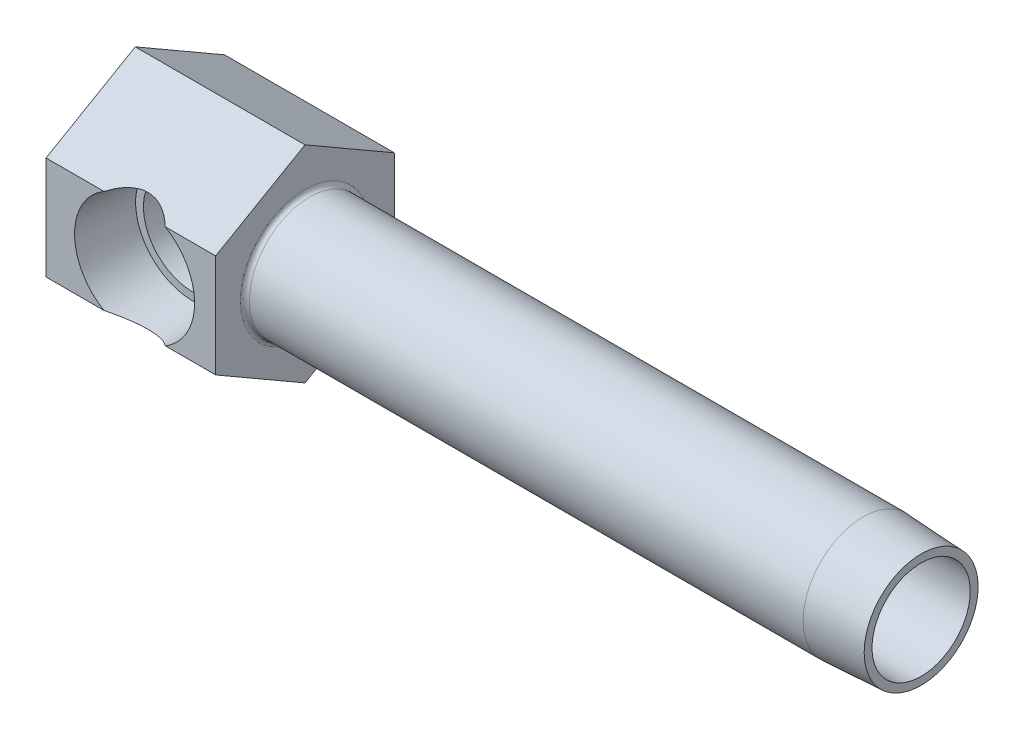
ISO-10303-21;
HEADER;
FILE_DESCRIPTION(('STEP AP214'),'2;1');
FILE_NAME('part.step','',(''),(''),'','','');
FILE_SCHEMA(('AUTOMOTIVE_DESIGN { 1 0 10303 214 1 1 1 1 }'));
ENDSEC;
DATA;
#1=APPLICATION_CONTEXT('core data for automotive mechanical design processes');
#2=APPLICATION_PROTOCOL_DEFINITION('international standard','automotive_design',2000,#1);
#3=PRODUCT_CONTEXT('',#1,'mechanical');
#4=PRODUCT('Part','Part','',(#3));
#5=PRODUCT_RELATED_PRODUCT_CATEGORY('part','',(#4));
#6=PRODUCT_DEFINITION_FORMATION('','',#4);
#7=PRODUCT_DEFINITION_CONTEXT('part definition',#1,'design');
#8=PRODUCT_DEFINITION('design','',#6,#7);
#9=PRODUCT_DEFINITION_SHAPE('','',#8);
#10=(LENGTH_UNIT() NAMED_UNIT(*) SI_UNIT(.MILLI.,.METRE.));
#11=(NAMED_UNIT(*) PLANE_ANGLE_UNIT() SI_UNIT($,.RADIAN.));
#12=(NAMED_UNIT(*) SI_UNIT($,.STERADIAN.) SOLID_ANGLE_UNIT());
#13=UNCERTAINTY_MEASURE_WITH_UNIT(LENGTH_MEASURE(1.E-05),#10,'distance_accuracy_value','');
#14=(GEOMETRIC_REPRESENTATION_CONTEXT(3) GLOBAL_UNCERTAINTY_ASSIGNED_CONTEXT((#13)) GLOBAL_UNIT_ASSIGNED_CONTEXT((#10,
#11,#12)) REPRESENTATION_CONTEXT('',''));
#15=CARTESIAN_POINT('',(0.,0.,0.));
#16=DIRECTION('',(0.,0.,1.));
#17=DIRECTION('',(1.,0.,0.));
#18=AXIS2_PLACEMENT_3D('',#15,#16,#17);
#19=CARTESIAN_POINT('',(139.7,0.,15.875));
#20=DIRECTION('',(-1.,0.,0.));
#21=DIRECTION('',(0.,0.,1.));
#22=AXIS2_PLACEMENT_3D('',#19,#20,#21);
#23=PLANE('',#22);
#24=CARTESIAN_POINT('',(139.7,0.,15.875));
#25=DIRECTION('',(1.,0.,0.));
#26=DIRECTION('',(0.,0.,-1.));
#27=AXIS2_PLACEMENT_3D('',#24,#25,#26);
#28=CIRCLE('',#27,8.73124999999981);
#29=CARTESIAN_POINT('',(139.7,0.,7.14375000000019));
#30=VERTEX_POINT('',#29);
#31=EDGE_CURVE('E298',#30,#30,#28,.T.);
#32=ORIENTED_EDGE('',*,*,#31,.F.);
#33=EDGE_LOOP('',(#32));
#34=FACE_BOUND('',#33,.T.);
#35=CARTESIAN_POINT('',(139.7,0.,15.875));
#36=DIRECTION('',(-1.,0.,0.));
#37=DIRECTION('',(0.,0.,1.));
#38=AXIS2_PLACEMENT_3D('',#35,#36,#37);
#39=CIRCLE('',#38,10.127550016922);
#40=CARTESIAN_POINT('',(139.7,0.,26.002550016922));
#41=VERTEX_POINT('',#40);
#42=EDGE_CURVE('E317',#41,#41,#39,.T.);
#43=ORIENTED_EDGE('',*,*,#42,.F.);
#44=EDGE_LOOP('',(#43));
#45=FACE_BOUND('',#44,.T.);
#46=ADVANCED_FACE('F15',(#34,#45),#23,.F.);
#47=CARTESIAN_POINT('',(30.1625,18.3308710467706,15.875));
#48=DIRECTION('',(0.,-0.866025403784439,-0.5));
#49=DIRECTION('',(0.,0.5,-0.866025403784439));
#50=AXIS2_PLACEMENT_3D('',#47,#48,#49);
#51=PLANE('',#50);
#52=DIRECTION('',(0.,-0.5,0.866025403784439));
#53=VECTOR('',#52,1.);
#54=CARTESIAN_POINT('',(0.,18.3308710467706,15.875));
#55=LINE('',#54,#53);
#56=CARTESIAN_POINT('',(0.,18.3308710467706,15.875));
#57=VERTEX_POINT('',#56);
#58=CARTESIAN_POINT('',(0.,9.16543552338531,31.75));
#59=VERTEX_POINT('',#58);
#60=EDGE_CURVE('E146',#57,#59,#55,.T.);
#61=ORIENTED_EDGE('',*,*,#60,.T.);
#62=DIRECTION('',(-1.,0.,0.));
#63=VECTOR('',#62,1.);
#64=CARTESIAN_POINT('',(30.1625,9.16543552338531,31.75));
#65=LINE('',#64,#63);
#66=CARTESIAN_POINT('',(10.2889693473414,9.16543552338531,31.75));
#67=VERTEX_POINT('',#66);
#68=EDGE_CURVE('E177',#67,#59,#65,.T.);
#69=ORIENTED_EDGE('',*,*,#68,.F.);
#70=CARTESIAN_POINT('',(15.748,-1.05255916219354,49.4480859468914));
#71=DIRECTION('',(0.,-0.866025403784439,-0.5));
#72=DIRECTION('',(0.,-0.5,0.866025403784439));
#73=AXIS2_PLACEMENT_3D('',#70,#71,#72);
#74=ELLIPSE('',#73,23.191034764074,11.5476466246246);
#75=CARTESIAN_POINT('',(21.2070306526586,9.16543552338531,31.75));
#76=VERTEX_POINT('',#75);
#77=EDGE_CURVE('E137',#76,#67,#74,.F.);
#78=ORIENTED_EDGE('',*,*,#77,.F.);
#79=CARTESIAN_POINT('',(30.1625,9.16543552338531,31.75));
#80=VERTEX_POINT('',#79);
#81=EDGE_CURVE('E178',#80,#76,#65,.T.);
#82=ORIENTED_EDGE('',*,*,#81,.F.);
#83=DIRECTION('',(0.,-0.5,0.866025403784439));
#84=VECTOR('',#83,1.);
#85=CARTESIAN_POINT('',(30.1625,18.3308710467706,15.875));
#86=LINE('',#85,#84);
#87=CARTESIAN_POINT('',(30.1625,18.3308710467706,15.875));
#88=VERTEX_POINT('',#87);
#89=EDGE_CURVE('E162',#88,#80,#86,.T.);
#90=ORIENTED_EDGE('',*,*,#89,.F.);
#91=DIRECTION('',(-1.,0.,0.));
#92=VECTOR('',#91,1.);
#93=CARTESIAN_POINT('',(30.1625,18.3308710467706,15.875));
#94=LINE('',#93,#92);
#95=EDGE_CURVE('E181',#88,#57,#94,.T.);
#96=ORIENTED_EDGE('',*,*,#95,.T.);
#97=EDGE_LOOP('',(#61,#69,#78,#82,#90,#96));
#98=FACE_BOUND('',#97,.T.);
#99=ADVANCED_FACE('F210',(#98),#51,.F.);
#100=CARTESIAN_POINT('',(30.1625,9.16543552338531,31.75));
#101=DIRECTION('',(0.,0.,-1.));
#102=DIRECTION('',(-1.,0.,0.));
#103=AXIS2_PLACEMENT_3D('',#100,#101,#102);
#104=PLANE('',#103);
#105=CARTESIAN_POINT('',(15.748,0.,31.75));
#106=DIRECTION('',(0.,0.,-1.));
#107=DIRECTION('',(-1.,0.,0.));
#108=AXIS2_PLACEMENT_3D('',#105,#106,#107);
#109=CIRCLE('',#108,10.668);
#110=CARTESIAN_POINT('',(21.2070306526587,-9.1654355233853,31.75));
#111=VERTEX_POINT('',#110);
#112=EDGE_CURVE('E135',#76,#111,#109,.T.);
#113=ORIENTED_EDGE('',*,*,#112,.T.);
#114=DIRECTION('',(-1.,0.,0.));
#115=VECTOR('',#114,1.);
#116=CARTESIAN_POINT('',(30.1625,-9.1654355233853,31.75));
#117=LINE('',#116,#115);
#118=CARTESIAN_POINT('',(30.1625,-9.1654355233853,31.75));
#119=VERTEX_POINT('',#118);
#120=EDGE_CURVE('E174',#119,#111,#117,.T.);
#121=ORIENTED_EDGE('',*,*,#120,.F.);
#122=DIRECTION('',(0.,-1.,0.));
#123=VECTOR('',#122,1.);
#124=CARTESIAN_POINT('',(30.1625,9.16543552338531,31.75));
#125=LINE('',#124,#123);
#126=EDGE_CURVE('E164',#80,#119,#125,.T.);
#127=ORIENTED_EDGE('',*,*,#126,.F.);
#128=ORIENTED_EDGE('',*,*,#81,.T.);
#129=EDGE_LOOP('',(#113,#121,#127,#128));
#130=FACE_BOUND('',#129,.T.);
#131=ADVANCED_FACE('F206',(#130),#104,.F.);
#132=DIRECTION('',(0.,-1.,0.));
#133=VECTOR('',#132,1.);
#134=CARTESIAN_POINT('',(0.,9.16543552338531,31.75));
#135=LINE('',#134,#133);
#136=CARTESIAN_POINT('',(0.,-9.1654355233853,31.75));
#137=VERTEX_POINT('',#136);
#138=EDGE_CURVE('E149',#59,#137,#135,.T.);
#139=ORIENTED_EDGE('',*,*,#138,.T.);
#140=CARTESIAN_POINT('',(10.2889693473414,-9.1654355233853,31.75));
#141=VERTEX_POINT('',#140);
#142=EDGE_CURVE('E173',#141,#137,#117,.T.);
#143=ORIENTED_EDGE('',*,*,#142,.F.);
#144=EDGE_CURVE('E43',#141,#67,#109,.T.);
#145=ORIENTED_EDGE('',*,*,#144,.T.);
#146=ORIENTED_EDGE('',*,*,#68,.T.);
#147=EDGE_LOOP('',(#139,#143,#145,#146));
#148=FACE_BOUND('',#147,.T.);
#149=ADVANCED_FACE('F216',(#148),#104,.F.);
#150=CARTESIAN_POINT('',(30.1625,-9.1654355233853,31.75));
#151=DIRECTION('',(0.,0.866025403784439,-0.5));
#152=DIRECTION('',(0.,0.5,0.866025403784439));
#153=AXIS2_PLACEMENT_3D('',#150,#151,#152);
#154=PLANE('',#153);
#155=DIRECTION('',(0.,-0.5,-0.866025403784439));
#156=VECTOR('',#155,1.);
#157=CARTESIAN_POINT('',(0.,-9.1654355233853,31.75));
#158=LINE('',#157,#156);
#159=CARTESIAN_POINT('',(0.,-18.3308710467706,15.875));
#160=VERTEX_POINT('',#159);
#161=EDGE_CURVE('E152',#137,#160,#158,.T.);
#162=ORIENTED_EDGE('',*,*,#161,.T.);
#163=DIRECTION('',(-1.,0.,0.));
#164=VECTOR('',#163,1.);
#165=CARTESIAN_POINT('',(30.1625,-18.3308710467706,15.875));
#166=LINE('',#165,#164);
#167=CARTESIAN_POINT('',(30.1625,-18.3308710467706,15.875));
#168=VERTEX_POINT('',#167);
#169=EDGE_CURVE('E168',#168,#160,#166,.T.);
#170=ORIENTED_EDGE('',*,*,#169,.F.);
#171=DIRECTION('',(0.,-0.5,-0.866025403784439));
#172=VECTOR('',#171,1.);
#173=CARTESIAN_POINT('',(30.1625,-9.1654355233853,31.75));
#174=LINE('',#173,#172);
#175=EDGE_CURVE('E166',#119,#168,#174,.T.);
#176=ORIENTED_EDGE('',*,*,#175,.F.);
#177=ORIENTED_EDGE('',*,*,#120,.T.);
#178=CARTESIAN_POINT('',(15.748,1.05255916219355,49.4480859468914));
#179=DIRECTION('',(0.,0.866025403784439,-0.5));
#180=DIRECTION('',(0.,0.5,0.866025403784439));
#181=AXIS2_PLACEMENT_3D('',#178,#179,#180);
#182=ELLIPSE('',#181,23.191034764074,11.5476466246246);
#183=EDGE_CURVE('E29',#141,#111,#182,.F.);
#184=ORIENTED_EDGE('',*,*,#183,.F.);
#185=ORIENTED_EDGE('',*,*,#142,.T.);
#186=EDGE_LOOP('',(#162,#170,#176,#177,#184,#185));
#187=FACE_BOUND('',#186,.T.);
#188=ADVANCED_FACE('F202',(#187),#154,.F.);
#189=CARTESIAN_POINT('',(30.1625,-18.3308710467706,15.875));
#190=DIRECTION('',(0.,0.866025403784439,0.5));
#191=DIRECTION('',(0.,-0.5,0.866025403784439));
#192=AXIS2_PLACEMENT_3D('',#189,#190,#191);
#193=PLANE('',#192);
#194=DIRECTION('',(0.,0.5,-0.866025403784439));
#195=VECTOR('',#194,1.);
#196=CARTESIAN_POINT('',(0.,-18.3308710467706,15.875));
#197=LINE('',#196,#195);
#198=CARTESIAN_POINT('',(0.,-9.16543552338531,0.));
#199=VERTEX_POINT('',#198);
#200=EDGE_CURVE('E139',#160,#199,#197,.T.);
#201=ORIENTED_EDGE('',*,*,#200,.T.);
#202=DIRECTION('',(-1.,0.,0.));
#203=VECTOR('',#202,1.);
#204=CARTESIAN_POINT('',(30.1625,-9.16543552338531,0.));
#205=LINE('',#204,#203);
#206=CARTESIAN_POINT('',(30.1625,-9.16543552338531,0.));
#207=VERTEX_POINT('',#206);
#208=EDGE_CURVE('E187',#207,#199,#205,.T.);
#209=ORIENTED_EDGE('',*,*,#208,.F.);
#210=DIRECTION('',(0.,0.5,-0.866025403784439));
#211=VECTOR('',#210,1.);
#212=CARTESIAN_POINT('',(30.1625,-18.3308710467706,15.875));
#213=LINE('',#212,#211);
#214=EDGE_CURVE('E155',#168,#207,#213,.T.);
#215=ORIENTED_EDGE('',*,*,#214,.F.);
#216=ORIENTED_EDGE('',*,*,#169,.T.);
#217=EDGE_LOOP('',(#201,#209,#215,#216));
#218=FACE_BOUND('',#217,.T.);
#219=ADVANCED_FACE('F225',(#218),#193,.F.);
#220=CARTESIAN_POINT('',(30.1625,-9.16543552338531,0.));
#221=DIRECTION('',(0.,0.,1.));
#222=DIRECTION('',(0.,-1.,0.));
#223=AXIS2_PLACEMENT_3D('',#220,#221,#222);
#224=PLANE('',#223);
#225=DIRECTION('',(0.,1.,0.));
#226=VECTOR('',#225,1.);
#227=CARTESIAN_POINT('',(0.,-9.16543552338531,0.));
#228=LINE('',#227,#226);
#229=CARTESIAN_POINT('',(0.,9.16543552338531,0.));
#230=VERTEX_POINT('',#229);
#231=EDGE_CURVE('E140',#199,#230,#228,.T.);
#232=ORIENTED_EDGE('',*,*,#231,.T.);
#233=DIRECTION('',(-1.,0.,0.));
#234=VECTOR('',#233,1.);
#235=CARTESIAN_POINT('',(30.1625,9.16543552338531,0.));
#236=LINE('',#235,#234);
#237=CARTESIAN_POINT('',(30.1625,9.16543552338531,0.));
#238=VERTEX_POINT('',#237);
#239=EDGE_CURVE('E184',#238,#230,#236,.T.);
#240=ORIENTED_EDGE('',*,*,#239,.F.);
#241=DIRECTION('',(0.,1.,0.));
#242=VECTOR('',#241,1.);
#243=CARTESIAN_POINT('',(30.1625,-9.16543552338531,0.));
#244=LINE('',#243,#242);
#245=EDGE_CURVE('E158',#207,#238,#244,.T.);
#246=ORIENTED_EDGE('',*,*,#245,.F.);
#247=ORIENTED_EDGE('',*,*,#208,.T.);
#248=EDGE_LOOP('',(#232,#240,#246,#247));
#249=FACE_BOUND('',#248,.T.);
#250=ADVANCED_FACE('F235',(#249),#224,.F.);
#251=CARTESIAN_POINT('',(30.1625,9.16543552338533,0.));
#252=DIRECTION('',(0.,-0.86602540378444,0.5));
#253=DIRECTION('',(0.,-0.5,-0.86602540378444));
#254=AXIS2_PLACEMENT_3D('',#251,#252,#253);
#255=PLANE('',#254);
#256=DIRECTION('',(0.,0.5,0.86602540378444));
#257=VECTOR('',#256,1.);
#258=CARTESIAN_POINT('',(0.,9.16543552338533,0.));
#259=LINE('',#258,#257);
#260=EDGE_CURVE('E143',#230,#57,#259,.T.);
#261=ORIENTED_EDGE('',*,*,#260,.T.);
#262=ORIENTED_EDGE('',*,*,#95,.F.);
#263=DIRECTION('',(0.,0.5,0.86602540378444));
#264=VECTOR('',#263,1.);
#265=CARTESIAN_POINT('',(30.1625,9.16543552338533,0.));
#266=LINE('',#265,#264);
#267=EDGE_CURVE('E160',#238,#88,#266,.T.);
#268=ORIENTED_EDGE('',*,*,#267,.F.);
#269=ORIENTED_EDGE('',*,*,#239,.T.);
#270=EDGE_LOOP('',(#261,#262,#268,#269));
#271=FACE_BOUND('',#270,.T.);
#272=ADVANCED_FACE('F233',(#271),#255,.F.);
#273=CARTESIAN_POINT('',(30.1625,-9.16543552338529,0.));
#274=DIRECTION('',(1.,0.,0.));
#275=DIRECTION('',(0.,1.,0.));
#276=AXIS2_PLACEMENT_3D('',#273,#274,#275);
#277=PLANE('',#276);
#278=CARTESIAN_POINT('',(30.1625,0.,15.875));
#279=DIRECTION('',(1.,0.,0.));
#280=DIRECTION('',(0.,1.,0.));
#281=AXIS2_PLACEMENT_3D('',#278,#279,#280);
#282=CIRCLE('',#281,11.4554);
#283=CARTESIAN_POINT('',(30.1625,11.4554,15.875));
#284=VERTEX_POINT('',#283);
#285=EDGE_CURVE('E193',#284,#284,#282,.F.);
#286=ORIENTED_EDGE('',*,*,#285,.T.);
#287=EDGE_LOOP('',(#286));
#288=FACE_BOUND('',#287,.T.);
#289=ORIENTED_EDGE('',*,*,#214,.T.);
#290=ORIENTED_EDGE('',*,*,#245,.T.);
#291=ORIENTED_EDGE('',*,*,#267,.T.);
#292=ORIENTED_EDGE('',*,*,#89,.T.);
#293=ORIENTED_EDGE('',*,*,#126,.T.);
#294=ORIENTED_EDGE('',*,*,#175,.T.);
#295=EDGE_LOOP('',(#289,#290,#291,#292,#293,#294));
#296=FACE_BOUND('',#295,.T.);
#297=ADVANCED_FACE('F228',(#288,#296),#277,.T.);
#298=CARTESIAN_POINT('',(0.,-9.16543552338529,0.));
#299=DIRECTION('',(1.,0.,0.));
#300=DIRECTION('',(0.,1.,0.));
#301=AXIS2_PLACEMENT_3D('',#298,#299,#300);
#302=PLANE('',#301);
#303=ORIENTED_EDGE('',*,*,#60,.F.);
#304=ORIENTED_EDGE('',*,*,#260,.F.);
#305=ORIENTED_EDGE('',*,*,#231,.F.);
#306=ORIENTED_EDGE('',*,*,#200,.F.);
#307=ORIENTED_EDGE('',*,*,#161,.F.);
#308=ORIENTED_EDGE('',*,*,#138,.F.);
#309=EDGE_LOOP('',(#303,#304,#305,#306,#307,#308));
#310=FACE_BOUND('',#309,.T.);
#311=ADVANCED_FACE('F219',(#310),#302,.F.);
#312=CARTESIAN_POINT('',(139.7,0.,15.875));
#313=DIRECTION('',(-1.,0.,0.));
#314=DIRECTION('',(0.,0.,1.));
#315=AXIS2_PLACEMENT_3D('',#312,#313,#314);
#316=CYLINDRICAL_SURFACE('',#315,10.668);
#317=CARTESIAN_POINT('',(129.3876,0.,15.875));
#318=DIRECTION('',(-1.,0.,0.));
#319=DIRECTION('',(0.,0.,1.));
#320=AXIS2_PLACEMENT_3D('',#317,#318,#319);
#321=CIRCLE('',#320,10.6680000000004);
#322=CARTESIAN_POINT('',(129.3876,0.,26.5430000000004));
#323=VERTEX_POINT('',#322);
#324=EDGE_CURVE('E314',#323,#323,#321,.T.);
#325=ORIENTED_EDGE('',*,*,#324,.T.);
#326=EDGE_LOOP('',(#325));
#327=FACE_BOUND('',#326,.T.);
#328=CARTESIAN_POINT('',(30.9499,0.,15.875));
#329=DIRECTION('',(1.,0.,0.));
#330=DIRECTION('',(0.,1.,0.));
#331=AXIS2_PLACEMENT_3D('',#328,#329,#330);
#332=CIRCLE('',#331,10.668);
#333=CARTESIAN_POINT('',(30.9499,10.668,15.875));
#334=VERTEX_POINT('',#333);
#335=EDGE_CURVE('E190',#334,#334,#332,.T.);
#336=ORIENTED_EDGE('',*,*,#335,.T.);
#337=EDGE_LOOP('',(#336));
#338=FACE_BOUND('',#337,.T.);
#339=ADVANCED_FACE('F261',(#327,#338),#316,.T.);
#340=CARTESIAN_POINT('',(30.9499,0.,15.875));
#341=DIRECTION('',(1.,0.,0.));
#342=DIRECTION('',(0.,1.,0.));
#343=AXIS2_PLACEMENT_3D('',#340,#341,#342);
#344=TOROIDAL_SURFACE('',#343,11.4554,0.7874);
#345=ORIENTED_EDGE('',*,*,#285,.F.);
#346=EDGE_LOOP('',(#345));
#347=FACE_BOUND('',#346,.T.);
#348=ORIENTED_EDGE('',*,*,#335,.F.);
#349=EDGE_LOOP('',(#348));
#350=FACE_BOUND('',#349,.T.);
#351=ADVANCED_FACE('F259',(#347,#350),#344,.F.);
#352=CARTESIAN_POINT('',(15.748,0.,31.75));
#353=DIRECTION('',(0.,0.,1.));
#354=DIRECTION('',(1.,0.,0.));
#355=AXIS2_PLACEMENT_3D('',#352,#353,#354);
#356=CONICAL_SURFACE('',#355,10.668,0.0523598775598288);
#357=ORIENTED_EDGE('',*,*,#77,.T.);
#358=ORIENTED_EDGE('',*,*,#144,.F.);
#359=ORIENTED_EDGE('',*,*,#183,.T.);
#360=ORIENTED_EDGE('',*,*,#112,.F.);
#361=EDGE_LOOP('',(#357,#358,#359,#360));
#362=FACE_BOUND('',#361,.T.);
#363=CARTESIAN_POINT('',(23.3158678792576,-6.73011387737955,21.4374));
#364=CARTESIAN_POINT('',(23.4600282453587,-6.58213571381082,21.6163914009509));
#365=CARTESIAN_POINT('',(23.6023884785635,-6.42627781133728,21.7904706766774));
#366=CARTESIAN_POINT('',(23.8817354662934,-6.09837401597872,22.1280133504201));
#367=CARTESIAN_POINT('',(24.0187135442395,-5.92630339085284,22.2914598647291));
#368=CARTESIAN_POINT('',(24.2862441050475,-5.56440643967,22.6077795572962));
#369=CARTESIAN_POINT('',(24.4167288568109,-5.3744362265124,22.7605461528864));
#370=CARTESIAN_POINT('',(24.6677167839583,-4.97815123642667,23.0522714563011));
#371=CARTESIAN_POINT('',(24.7882261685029,-4.77184678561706,23.1912387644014));
#372=CARTESIAN_POINT('',(24.9921660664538,-4.38969848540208,23.4250980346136));
#373=CARTESIAN_POINT('',(25.0779672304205,-4.21696245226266,23.5230096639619));
#374=CARTESIAN_POINT('',(25.2408840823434,-3.86199712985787,23.7082473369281));
#375=CARTESIAN_POINT('',(25.3180018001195,-3.67977007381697,23.7955758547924));
#376=CARTESIAN_POINT('',(25.4621670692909,-3.30686520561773,23.9583559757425));
#377=CARTESIAN_POINT('',(25.529240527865,-3.11621083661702,24.0338381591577));
#378=CARTESIAN_POINT('',(25.6523303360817,-2.72696762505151,24.1720474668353));
#379=CARTESIAN_POINT('',(25.7083523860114,-2.52838293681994,24.2347811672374));
#380=CARTESIAN_POINT('',(25.808749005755,-2.12236093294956,24.3470188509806));
#381=CARTESIAN_POINT('',(25.8530023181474,-1.91485526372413,24.3963851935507));
#382=CARTESIAN_POINT('',(25.9281094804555,-1.49442789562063,24.4800766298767));
#383=CARTESIAN_POINT('',(25.9589631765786,-1.2815061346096,24.5144015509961));
#384=CARTESIAN_POINT('',(26.0065047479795,-0.852126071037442,24.5672608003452));
#385=CARTESIAN_POINT('',(26.023192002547,-0.635667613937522,24.5857944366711));
#386=CARTESIAN_POINT('',(26.0419565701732,-0.201352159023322,24.6066338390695));
#387=CARTESIAN_POINT('',(26.0440358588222,0.0165046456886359,24.6089417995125));
#388=CARTESIAN_POINT('',(26.0342583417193,0.421689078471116,24.5980844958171));
#389=CARTESIAN_POINT('',(26.0242658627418,0.609123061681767,24.5869892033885));
#390=CARTESIAN_POINT('',(25.9935596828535,0.982016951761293,24.552869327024));
#391=CARTESIAN_POINT('',(25.9728460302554,1.16747686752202,24.5298447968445));
#392=CARTESIAN_POINT('',(25.9211099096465,1.53498981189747,24.4722733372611));
#393=CARTESIAN_POINT('',(25.8900948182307,1.71704518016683,24.437734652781));
#394=CARTESIAN_POINT('',(25.8183100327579,2.07675633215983,24.3576745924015));
#395=CARTESIAN_POINT('',(25.7775399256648,2.25441192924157,24.3121527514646));
#396=CARTESIAN_POINT('',(25.6868155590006,2.6047674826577,24.2106610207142));
#397=CARTESIAN_POINT('',(25.6368406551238,2.77745527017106,24.1546676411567));
#398=CARTESIAN_POINT('',(25.5285266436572,3.11671661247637,24.0330221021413));
#399=CARTESIAN_POINT('',(25.4701845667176,3.28328797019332,23.9673665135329));
#400=CARTESIAN_POINT('',(25.2834921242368,3.77365322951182,23.7566792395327));
#401=CARTESIAN_POINT('',(25.1436492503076,4.08744436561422,23.5981203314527));
#402=CARTESIAN_POINT('',(24.8735653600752,4.6189606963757,23.289353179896));
#403=CARTESIAN_POINT('',(24.7480029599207,4.84261456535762,23.1450088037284));
#404=CARTESIAN_POINT('',(24.4850001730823,5.27158893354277,22.8402219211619));
#405=CARTESIAN_POINT('',(24.34754826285,5.47689124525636,22.6797637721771));
#406=CARTESIAN_POINT('',(24.0644488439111,5.86754844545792,22.3458754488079));
#407=CARTESIAN_POINT('',(23.918859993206,6.05302358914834,22.1725357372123));
#408=CARTESIAN_POINT('',(23.6957580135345,6.31733501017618,21.90341371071));
#409=CARTESIAN_POINT('',(23.6206767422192,6.40304815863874,21.8122772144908));
#410=CARTESIAN_POINT('',(23.4691939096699,6.56995442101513,21.6270388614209));
#411=CARTESIAN_POINT('',(23.3927925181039,6.65114811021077,21.5329373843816));
#412=CARTESIAN_POINT('',(23.3158678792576,6.73011387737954,21.4374));
#413=B_SPLINE_CURVE_WITH_KNOTS('',3,(#363,#364,#365,#366,#367,#368,#369,#370,#371,#372,#373,
#374,#375,#376,#377,#378,#379,#380,#381,#382,#383,#384,#385,#386,#387,#388,#389,#390,#391,#392,
#393,#394,#395,#396,#397,#398,#399,#400,#401,#402,#403,#404,#405,#406,#407,#408,#409,#410,#411,
#412),.UNSPECIFIED.,.F.,.F.,(4,2,2,2,2,2,2,2,2,2,2,2,2,2,2,2,2,2,2,2,2,2,2,2,4),(0.,
0.820023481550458,1.64131879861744,2.46989520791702,3.29795193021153,3.94627694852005,
4.59445010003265,5.24092150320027,5.8870585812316,6.53961554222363,7.19217999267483,
7.84477303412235,8.49727781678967,9.06067705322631,9.62407375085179,10.187067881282,
10.7500858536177,11.3143822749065,11.8788794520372,13.0099648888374,13.8917191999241,
14.7743379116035,15.65125682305,16.0888974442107,16.5264822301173),.UNSPECIFIED.);
#414=CARTESIAN_POINT('',(23.3160289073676,-6.72994857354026,21.4376));
#415=VERTEX_POINT('',#414);
#416=CARTESIAN_POINT('',(23.3160289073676,6.72994857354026,21.4376));
#417=VERTEX_POINT('',#416);
#418=EDGE_CURVE('E122',#415,#417,#413,.T.);
#419=ORIENTED_EDGE('',*,*,#418,.F.);
#420=CARTESIAN_POINT('',(15.748,0.,21.4376));
#421=DIRECTION('',(0.,0.,-1.));
#422=DIRECTION('',(-1.,0.,0.));
#423=AXIS2_PLACEMENT_3D('',#420,#421,#422);
#424=CIRCLE('',#423,10.1275500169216);
#425=EDGE_CURVE('E124',#415,#417,#424,.T.);
#426=ORIENTED_EDGE('',*,*,#425,.T.);
#427=EDGE_LOOP('',(#419,#426));
#428=FACE_BOUND('',#427,.T.);
#429=ADVANCED_FACE('F17',(#362,#428),#356,.F.);
#430=CARTESIAN_POINT('',(25.8755500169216,0.,21.4376));
#431=DIRECTION('',(0.,0.,1.));
#432=DIRECTION('',(1.,0.,0.));
#433=AXIS2_PLACEMENT_3D('',#430,#431,#432);
#434=PLANE('',#433);
#435=DIRECTION('',(1.,0.,0.));
#436=VECTOR('',#435,1.);
#437=CARTESIAN_POINT('',(86.8155901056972,-6.72994857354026,21.4376));
#438=LINE('',#437,#436);
#439=CARTESIAN_POINT('',(21.3205618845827,-6.72994857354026,21.4376));
#440=VERTEX_POINT('',#439);
#441=EDGE_CURVE('E126',#440,#415,#438,.T.);
#442=ORIENTED_EDGE('',*,*,#441,.F.);
#443=CARTESIAN_POINT('',(15.748,0.,21.4376));
#444=DIRECTION('',(0.,0.,-1.));
#445=DIRECTION('',(-1.,0.,0.));
#446=AXIS2_PLACEMENT_3D('',#443,#444,#445);
#447=CIRCLE('',#446,8.7376);
#448=CARTESIAN_POINT('',(21.3205618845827,6.72994857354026,21.4376));
#449=VERTEX_POINT('',#448);
#450=EDGE_CURVE('E117',#440,#449,#447,.T.);
#451=ORIENTED_EDGE('',*,*,#450,.T.);
#452=DIRECTION('',(1.,0.,0.));
#453=VECTOR('',#452,1.);
#454=CARTESIAN_POINT('',(86.8155901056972,6.72994857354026,21.4376));
#455=LINE('',#454,#453);
#456=EDGE_CURVE('E118',#417,#449,#455,.F.);
#457=ORIENTED_EDGE('',*,*,#456,.F.);
#458=ORIENTED_EDGE('',*,*,#425,.F.);
#459=EDGE_LOOP('',(#442,#451,#457,#458));
#460=FACE_BOUND('',#459,.T.);
#461=ADVANCED_FACE('F281',(#460),#434,.T.);
#462=CARTESIAN_POINT('',(15.748,0.,43.0975954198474));
#463=DIRECTION('',(0.,0.,-1.));
#464=DIRECTION('',(-1.,0.,0.));
#465=AXIS2_PLACEMENT_3D('',#462,#463,#464);
#466=CYLINDRICAL_SURFACE('',#465,8.7376);
#467=CARTESIAN_POINT('',(24.4856,0.,7.14375000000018));
#468=CARTESIAN_POINT('',(24.4855979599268,-0.194584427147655,7.14375204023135));
#469=CARTESIAN_POINT('',(24.4790855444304,-0.389211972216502,7.15026918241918));
#470=CARTESIAN_POINT('',(24.4531687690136,-0.776828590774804,7.17620489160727));
#471=CARTESIAN_POINT('',(24.4337566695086,-0.969816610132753,7.19563120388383));
#472=CARTESIAN_POINT('',(24.3824080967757,-1.35279132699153,7.24701779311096));
#473=CARTESIAN_POINT('',(24.3504484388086,-1.54277178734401,7.27900127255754));
#474=CARTESIAN_POINT('',(24.2746397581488,-1.91800162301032,7.35486734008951));
#475=CARTESIAN_POINT('',(24.230784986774,-2.10324866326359,7.39875568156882));
#476=CARTESIAN_POINT('',(24.1323992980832,-2.46629304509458,7.49721818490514));
#477=CARTESIAN_POINT('',(24.0779544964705,-2.64413729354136,7.55170615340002));
#478=CARTESIAN_POINT('',(23.9590478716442,-2.99304779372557,7.67070931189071));
#479=CARTESIAN_POINT('',(23.8945822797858,-3.16411146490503,7.73522827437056));
#480=CARTESIAN_POINT('',(23.7566100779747,-3.49864884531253,7.8733179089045));
#481=CARTESIAN_POINT('',(23.6831076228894,-3.66212599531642,7.9468844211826));
#482=CARTESIAN_POINT('',(23.5279457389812,-3.98115293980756,8.10218588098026));
#483=CARTESIAN_POINT('',(23.4462844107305,-4.13670087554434,8.18392273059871));
#484=CARTESIAN_POINT('',(23.2407563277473,-4.50158308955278,8.38964777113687));
#485=CARTESIAN_POINT('',(23.1132942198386,-4.70687702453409,8.51723745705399));
#486=CARTESIAN_POINT('',(22.84617651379,-5.10080513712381,8.78463889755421));
#487=CARTESIAN_POINT('',(22.7065197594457,-5.28943773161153,8.92445181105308));
#488=CARTESIAN_POINT('',(22.4166157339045,-5.65057111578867,9.21470277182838));
#489=CARTESIAN_POINT('',(22.2663444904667,-5.82303320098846,9.36516487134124));
#490=CARTESIAN_POINT('',(21.9571971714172,-6.15161912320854,9.67473646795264));
#491=CARTESIAN_POINT('',(21.7983210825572,-6.30774293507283,9.833845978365));
#492=CARTESIAN_POINT('',(21.410466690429,-6.66146937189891,10.2223222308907));
#493=CARTESIAN_POINT('',(21.1781519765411,-6.85174414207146,10.4550504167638));
#494=CARTESIAN_POINT('',(20.7027527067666,-7.20301910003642,10.9314300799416));
#495=CARTESIAN_POINT('',(20.4596630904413,-7.364005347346,11.1750866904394));
#496=CARTESIAN_POINT('',(19.9655914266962,-7.65767994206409,11.6705392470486));
#497=CARTESIAN_POINT('',(19.7146188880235,-7.79040098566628,11.922325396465));
#498=CARTESIAN_POINT('',(19.2066974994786,-8.02880543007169,12.432296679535));
#499=CARTESIAN_POINT('',(18.9497514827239,-8.13450137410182,12.6904787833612));
#500=CARTESIAN_POINT('',(18.535849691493,-8.28254836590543,13.1070621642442));
#501=CARTESIAN_POINT('',(18.3802144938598,-8.3332845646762,13.2638590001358));
#502=CARTESIAN_POINT('',(18.0678223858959,-8.42559206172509,13.5791092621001));
#503=CARTESIAN_POINT('',(17.9110652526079,-8.46716148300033,13.7375630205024));
#504=CARTESIAN_POINT('',(17.6309955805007,-8.53322740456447,14.0215802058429));
#505=CARTESIAN_POINT('',(17.5077848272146,-8.5594718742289,14.1468425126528));
#506=CARTESIAN_POINT('',(17.2618022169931,-8.60637337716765,14.3980579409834));
#507=CARTESIAN_POINT('',(17.1390302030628,-8.62704779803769,14.5240076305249));
#508=CARTESIAN_POINT('',(16.9357825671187,-8.65687758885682,14.7346643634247));
#509=CARTESIAN_POINT('',(16.8550481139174,-8.66756378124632,14.8189101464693));
#510=CARTESIAN_POINT('',(16.6937016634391,-8.68665280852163,14.9894220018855));
#511=CARTESIAN_POINT('',(16.6130990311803,-8.6950316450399,15.0756998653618));
#512=CARTESIAN_POINT('',(16.4936864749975,-8.70581636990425,15.2075729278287));
#513=CARTESIAN_POINT('',(16.4538975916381,-8.7091283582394,15.2522143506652));
#514=CARTESIAN_POINT('',(16.3753514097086,-8.71513811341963,15.3428639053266));
#515=CARTESIAN_POINT('',(16.3366000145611,-8.71783283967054,15.3888775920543));
#516=CARTESIAN_POINT('',(16.262384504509,-8.72252382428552,15.4819945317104));
#517=CARTESIAN_POINT('',(16.2268715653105,-8.72453249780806,15.5290599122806));
#518=CARTESIAN_POINT('',(16.1615894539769,-8.72786360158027,15.6269900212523));
#519=CARTESIAN_POINT('',(16.131762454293,-8.72919320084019,15.6778082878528));
#520=CARTESIAN_POINT('',(16.1060265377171,-8.73026315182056,15.7432733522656));
#521=CARTESIAN_POINT('',(16.1020065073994,-8.73042652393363,15.7545502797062));
#522=CARTESIAN_POINT('',(16.0948910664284,-8.73071197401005,15.7773932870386));
#523=CARTESIAN_POINT('',(16.0917959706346,-8.73083403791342,15.788959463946));
#524=CARTESIAN_POINT('',(16.0842173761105,-8.73113051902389,15.8238300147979));
#525=CARTESIAN_POINT('',(16.0813461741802,-8.73123899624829,15.847528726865));
#526=CARTESIAN_POINT('',(16.0808088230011,-8.73125946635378,15.8951415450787));
#527=CARTESIAN_POINT('',(16.0831777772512,-8.73117013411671,15.9190560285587));
#528=CARTESIAN_POINT('',(16.0925113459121,-8.73080677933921,15.9661053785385));
#529=CARTESIAN_POINT('',(16.0995149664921,-8.73053118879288,15.9892318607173));
#530=CARTESIAN_POINT('',(16.1262284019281,-8.72942751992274,16.0598051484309));
#531=CARTESIAN_POINT('',(16.1513370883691,-8.72832740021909,16.1050597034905));
#532=CARTESIAN_POINT('',(16.2067600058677,-8.72559491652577,16.1922079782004));
#533=CARTESIAN_POINT('',(16.2371111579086,-8.72395869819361,16.2340745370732));
#534=CARTESIAN_POINT('',(16.3394034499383,-8.71784635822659,16.3674166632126));
#535=CARTESIAN_POINT('',(16.4158450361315,-8.71237926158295,16.4553852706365));
#536=CARTESIAN_POINT('',(16.5713693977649,-8.69907947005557,16.6287851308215));
#537=CARTESIAN_POINT('',(16.6504566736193,-8.69124254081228,16.7142115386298));
#538=CARTESIAN_POINT('',(16.8096315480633,-8.67323190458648,16.8834717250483));
#539=CARTESIAN_POINT('',(16.8897156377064,-8.66306494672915,16.9673093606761));
#540=CARTESIAN_POINT('',(17.0502749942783,-8.64038918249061,17.1341543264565));
#541=CARTESIAN_POINT('',(17.1307499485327,-8.62788201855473,17.2171621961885));
#542=CARTESIAN_POINT('',(17.3707828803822,-8.58710464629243,17.463693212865));
#543=CARTESIAN_POINT('',(17.5305844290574,-8.55539515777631,17.6264322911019));
#544=CARTESIAN_POINT('',(17.8496978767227,-8.48264950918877,17.9503078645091));
#545=CARTESIAN_POINT('',(18.0090097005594,-8.44161198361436,18.1114441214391));
#546=CARTESIAN_POINT('',(18.48565286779,-8.30423407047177,18.5926956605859));
#547=CARTESIAN_POINT('',(18.8014587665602,-8.19366724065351,18.9104166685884));
#548=CARTESIAN_POINT('',(19.4255974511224,-7.93318916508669,19.5375986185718));
#549=CARTESIAN_POINT('',(19.7339228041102,-7.78324040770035,19.8470513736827));
#550=CARTESIAN_POINT('',(20.3391141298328,-7.44229907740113,20.4540803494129));
#551=CARTESIAN_POINT('',(20.6359893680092,-7.25134054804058,20.7516661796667));
#552=CARTESIAN_POINT('',(21.1000219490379,-6.91004415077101,21.2166598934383));
#553=CARTESIAN_POINT('',(21.2721889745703,-6.77335954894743,21.3891483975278));
#554=CARTESIAN_POINT('',(21.6095045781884,-6.4836611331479,21.7270430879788));
#555=CARTESIAN_POINT('',(21.7746536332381,-6.33064843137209,21.8924497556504));
#556=CARTESIAN_POINT('',(22.2570327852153,-5.8468207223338,22.3755293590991));
#557=CARTESIAN_POINT('',(22.5620480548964,-5.49060305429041,22.6809166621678));
#558=CARTESIAN_POINT('',(23.0699162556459,-4.78392446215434,23.1893448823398));
#559=CARTESIAN_POINT('',(23.2811256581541,-4.44561570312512,23.4007639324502));
#560=CARTESIAN_POINT('',(23.5668242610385,-3.90553017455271,23.6867285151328));
#561=CARTESIAN_POINT('',(23.6568667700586,-3.72007663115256,23.776851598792));
#562=CARTESIAN_POINT('',(23.8252338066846,-3.33876204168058,23.9453649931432));
#563=CARTESIAN_POINT('',(23.9035605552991,-3.14290297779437,24.0237575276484));
#564=CARTESIAN_POINT('',(24.0342740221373,-2.77741093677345,24.1545782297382));
#565=CARTESIAN_POINT('',(24.0887969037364,-2.60930304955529,24.2091448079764));
#566=CARTESIAN_POINT('',(24.1881404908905,-2.26745357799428,24.3085667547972));
#567=CARTESIAN_POINT('',(24.232963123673,-2.09371312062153,24.3534240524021));
#568=CARTESIAN_POINT('',(24.3121701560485,-1.74160557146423,24.4326916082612));
#569=CARTESIAN_POINT('',(24.3465592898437,-1.56324061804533,24.4671066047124));
#570=CARTESIAN_POINT('',(24.4043171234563,-1.2029580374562,24.5249075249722));
#571=CARTESIAN_POINT('',(24.427685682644,-1.02104036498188,24.548293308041));
#572=CARTESIAN_POINT('',(24.463023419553,-0.654283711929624,24.5836569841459));
#573=CARTESIAN_POINT('',(24.4749486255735,-0.469436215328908,24.5955908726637));
#574=CARTESIAN_POINT('',(24.4870048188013,-0.0989697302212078,24.6076558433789));
#575=CARTESIAN_POINT('',(24.4871357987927,0.0866492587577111,24.6077869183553));
#576=CARTESIAN_POINT('',(24.4756009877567,0.457153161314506,24.59624371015));
#577=CARTESIAN_POINT('',(24.4639348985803,0.642038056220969,24.5845691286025));
#578=CARTESIAN_POINT('',(24.4290390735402,1.00960102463,24.5496476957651));
#579=CARTESIAN_POINT('',(24.4058095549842,1.1922791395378,24.5264010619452));
#580=CARTESIAN_POINT('',(24.3499037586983,1.54359781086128,24.4704535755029));
#581=CARTESIAN_POINT('',(24.3178522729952,1.71243875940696,24.4383780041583));
#582=CARTESIAN_POINT('',(24.2443827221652,2.04605005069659,24.3648524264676));
#583=CARTESIAN_POINT('',(24.2029611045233,2.21081882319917,24.3233988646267));
#584=CARTESIAN_POINT('',(24.1113637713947,2.535396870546,24.231729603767));
#585=CARTESIAN_POINT('',(24.0611880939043,2.69520616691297,24.1815139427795));
#586=CARTESIAN_POINT('',(23.9527394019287,3.00923826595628,24.0729769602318));
#587=CARTESIAN_POINT('',(23.8944647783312,3.16345995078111,24.0146540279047));
#588=CARTESIAN_POINT('',(23.7478576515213,3.52103226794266,23.8679223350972));
#589=CARTESIAN_POINT('',(23.6563189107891,3.72176242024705,23.776303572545));
#590=CARTESIAN_POINT('',(23.4611265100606,4.11105686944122,23.5809334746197));
#591=CARTESIAN_POINT('',(23.3574693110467,4.29961758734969,23.4771785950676));
#592=CARTESIAN_POINT('',(23.1395028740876,4.66439092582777,23.2589969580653));
#593=CARTESIAN_POINT('',(23.0251788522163,4.84058579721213,23.1445553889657));
#594=CARTESIAN_POINT('',(22.7874660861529,5.18020722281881,22.9065848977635));
#595=CARTESIAN_POINT('',(22.6640769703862,5.34363325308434,22.7830556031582));
#596=CARTESIAN_POINT('',(22.3624933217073,5.715835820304,22.4811084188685));
#597=CARTESIAN_POINT('',(22.1808835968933,5.91907945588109,22.2992637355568));
#598=CARTESIAN_POINT('',(21.8058537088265,6.3023810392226,21.9236994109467));
#599=CARTESIAN_POINT('',(21.6124292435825,6.48243046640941,21.7299754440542));
#600=CARTESIAN_POINT('',(21.2157200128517,6.82038910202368,21.3325794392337));
#601=CARTESIAN_POINT('',(21.0124171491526,6.97825543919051,21.1288891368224));
#602=CARTESIAN_POINT('',(20.5982380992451,7.27223101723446,20.7138083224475));
#603=CARTESIAN_POINT('',(20.3873623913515,7.40834162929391,20.5024182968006));
#604=CARTESIAN_POINT('',(19.884649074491,7.7036329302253,19.9982794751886));
#605=CARTESIAN_POINT('',(19.59030513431,7.85421669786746,19.7029484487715));
#606=CARTESIAN_POINT('',(19.1430322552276,8.05270383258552,19.2536843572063));
#607=CARTESIAN_POINT('',(18.9929116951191,8.11432340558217,19.1028145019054));
#608=CARTESIAN_POINT('',(18.6911065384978,8.2285969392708,18.7992470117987));
#609=CARTESIAN_POINT('',(18.5394220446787,8.28125148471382,18.6465494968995));
#610=CARTESIAN_POINT('',(18.2352261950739,8.37763466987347,18.3399014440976));
#611=CARTESIAN_POINT('',(18.0827174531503,8.42138304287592,18.1859544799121));
#612=CARTESIAN_POINT('',(17.7769311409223,8.50023585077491,17.8765529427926));
#613=CARTESIAN_POINT('',(17.6236534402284,8.53533876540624,17.7210981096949));
#614=CARTESIAN_POINT('',(17.3172180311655,8.59695458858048,17.4087584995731));
#615=CARTESIAN_POINT('',(17.164060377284,8.62347694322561,17.2518754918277));
#616=CARTESIAN_POINT('',(16.8589569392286,8.66804695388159,16.9357683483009));
#617=CARTESIAN_POINT('',(16.7070105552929,8.68609909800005,16.7765454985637));
#618=CARTESIAN_POINT('',(16.4635040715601,8.70877341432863,16.5098735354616));
#619=CARTESIAN_POINT('',(16.3699008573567,8.71589085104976,16.4044258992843));
#620=CARTESIAN_POINT('',(16.2323264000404,8.72430499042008,16.2291085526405));
#621=CARTESIAN_POINT('',(16.1841543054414,8.72679002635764,16.1631387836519));
#622=CARTESIAN_POINT('',(16.133496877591,8.72910118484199,16.069881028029));
#623=CARTESIAN_POINT('',(16.1225051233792,8.72957575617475,16.0475182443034));
#624=CARTESIAN_POINT('',(16.1036531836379,8.73036364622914,16.001517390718));
#625=CARTESIAN_POINT('',(16.0957832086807,8.7306774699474,15.9778835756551));
#626=CARTESIAN_POINT('',(16.0858252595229,8.73106804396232,15.9345234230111));
#627=CARTESIAN_POINT('',(16.0828762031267,8.73118048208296,15.9150042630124));
#628=CARTESIAN_POINT('',(16.080484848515,8.73127193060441,15.8757632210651));
#629=CARTESIAN_POINT('',(16.0810378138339,8.73125112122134,15.8560416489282));
#630=CARTESIAN_POINT('',(16.0854969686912,8.73107971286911,15.8170943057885));
#631=CARTESIAN_POINT('',(16.0893884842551,8.73092968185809,15.7978667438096));
#632=CARTESIAN_POINT('',(16.099843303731,8.73051484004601,15.7601398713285));
#633=CARTESIAN_POINT('',(16.1064126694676,8.73024976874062,15.741642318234));
#634=CARTESIAN_POINT('',(16.1364699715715,8.72898749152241,15.6687660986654));
#635=CARTESIAN_POINT('',(16.1672759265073,8.72759479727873,15.6175941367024));
#636=CARTESIAN_POINT('',(16.2343481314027,8.72412321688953,15.5188553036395));
#637=CARTESIAN_POINT('',(16.2706691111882,8.72203717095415,15.4713327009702));
#638=CARTESIAN_POINT('',(16.3943809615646,8.71408023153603,15.3171540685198));
#639=CARTESIAN_POINT('',(16.4865189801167,8.70682435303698,15.2143256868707));
#640=CARTESIAN_POINT('',(16.6731786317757,8.68900060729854,15.0111482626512));
#641=CARTESIAN_POINT('',(16.7677038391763,8.67842746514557,14.9108034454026));
#642=CARTESIAN_POINT('',(16.957390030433,8.65402061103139,14.7119565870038));
#643=CARTESIAN_POINT('',(17.052545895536,8.64020255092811,14.613448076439));
#644=CARTESIAN_POINT('',(17.2430914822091,8.60927992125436,14.4173129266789));
#645=CARTESIAN_POINT('',(17.3384810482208,8.59217714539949,14.3196858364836));
#646=CARTESIAN_POINT('',(17.7459864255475,8.51203730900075,13.9038911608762));
#647=CARTESIAN_POINT('',(18.0580987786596,8.4329226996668,13.5886112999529));
#648=CARTESIAN_POINT('',(18.6776048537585,8.23825366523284,12.9641986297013));
#649=CARTESIAN_POINT('',(18.984994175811,8.12266719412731,12.6550714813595));
#650=CARTESIAN_POINT('',(19.5923220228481,7.8534892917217,12.0450114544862));
#651=CARTESIAN_POINT('',(19.892248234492,7.69983911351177,11.7440920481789));
#652=CARTESIAN_POINT('',(20.4804833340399,7.35294307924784,11.1542044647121));
#653=CARTESIAN_POINT('',(20.7688011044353,7.15972821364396,10.8652271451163));
#654=CARTESIAN_POINT('',(21.2206780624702,6.81483228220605,10.412455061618));
#655=CARTESIAN_POINT('',(21.3891940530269,6.6761727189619,10.2436383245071));
#656=CARTESIAN_POINT('',(21.7190895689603,6.38282740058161,9.91319894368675));
#657=CARTESIAN_POINT('',(21.8804695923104,6.2281427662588,9.75157579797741));
#658=CARTESIAN_POINT('',(22.3513310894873,5.73984762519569,9.28005235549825));
#659=CARTESIAN_POINT('',(22.64842486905,5.38133142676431,8.98260558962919));
#660=CARTESIAN_POINT('',(23.1414924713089,4.67228730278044,8.4890061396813));
#661=CARTESIAN_POINT('',(23.3459092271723,4.33363653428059,8.28439004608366));
#662=CARTESIAN_POINT('',(23.6214579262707,3.79409663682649,8.00858862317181));
#663=CARTESIAN_POINT('',(23.7081391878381,3.60895802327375,7.9218308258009));
#664=CARTESIAN_POINT('',(23.8698120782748,3.22869205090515,7.76001907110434));
#665=CARTESIAN_POINT('',(23.9448062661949,3.03356689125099,7.6849625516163));
#666=CARTESIAN_POINT('',(24.0697191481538,2.66926471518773,7.55994813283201));
#667=CARTESIAN_POINT('',(24.1217294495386,2.50151910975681,7.50789648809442));
#668=CARTESIAN_POINT('',(24.2160793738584,2.16067893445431,7.41347268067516));
#669=CARTESIAN_POINT('',(24.2584209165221,1.98758543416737,7.37109859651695));
#670=CARTESIAN_POINT('',(24.3326749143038,1.63737162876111,7.29678816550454));
#671=CARTESIAN_POINT('',(24.3646094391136,1.46026070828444,7.26482973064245));
#672=CARTESIAN_POINT('',(24.4175977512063,1.10287331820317,7.21180203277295));
#673=CARTESIAN_POINT('',(24.4386569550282,0.922598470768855,7.19072734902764));
#674=CARTESIAN_POINT('',(24.4645620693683,0.618421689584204,7.164803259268));
#675=CARTESIAN_POINT('',(24.4724435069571,0.495022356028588,7.15691607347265));
#676=CARTESIAN_POINT('',(24.48296362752,0.247754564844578,7.14638828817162));
#677=CARTESIAN_POINT('',(24.4856012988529,0.123886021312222,7.14374870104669));
#678=CARTESIAN_POINT('',(24.4856,0.,7.14375000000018));
#679=B_SPLINE_CURVE_WITH_KNOTS('',3,(#467,#468,#469,#470,#471,#472,#473,#474,#475,#476,#477,
#478,#479,#480,#481,#482,#483,#484,#485,#486,#487,#488,#489,#490,#491,#492,#493,#494,#495,#496,
#497,#498,#499,#500,#501,#502,#503,#504,#505,#506,#507,#508,#509,#510,#511,#512,#513,#514,#515,
#516,#517,#518,#519,#520,#521,#522,#523,#524,#525,#526,#527,#528,#529,#530,#531,#532,#533,#534,
#535,#536,#537,#538,#539,#540,#541,#542,#543,#544,#545,#546,#547,#548,#549,#550,#551,#552,#553,
#554,#555,#556,#557,#558,#559,#560,#561,#562,#563,#564,#565,#566,#567,#568,#569,#570,#571,#572,
#573,#574,#575,#576,#577,#578,#579,#580,#581,#582,#583,#584,#585,#586,#587,#588,#589,#590,#591,
#592,#593,#594,#595,#596,#597,#598,#599,#600,#601,#602,#603,#604,#605,#606,#607,#608,#609,#610,
#611,#612,#613,#614,#615,#616,#617,#618,#619,#620,#621,#622,#623,#624,#625,#626,#627,#628,#629,
#630,#631,#632,#633,#634,#635,#636,#637,#638,#639,#640,#641,#642,#643,#644,#645,#646,#647,#648,
#649,#650,#651,#652,#653,#654,#655,#656,#657,#658,#659,#660,#661,#662,#663,#664,#665,#666,#667,
#668,#669,#670,#671,#672,#673,#674,#675,#676,#677,#678),.UNSPECIFIED.,.T.,.F.,(4,2,2,2,2,2,2,2,
2,2,2,2,2,2,2,2,2,2,2,2,2,2,2,2,2,2,2,2,2,2,2,2,2,2,2,2,2,2,2,2,2,2,2,2,2,2,2,2,2,2,2,2,2,2,2,2,
2,2,2,2,2,2,2,2,2,2,2,2,2,2,2,2,2,2,2,2,2,2,2,2,2,2,2,2,2,2,2,2,2,2,2,2,2,2,2,2,2,2,2,2,2,2,2,2,
2,4),(0.,0.58361241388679,1.16757530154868,1.75262232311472,2.3379525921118,2.9187083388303,
3.49968302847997,4.08039159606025,4.66123567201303,5.47979311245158,6.29842824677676,
7.11897529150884,7.93952359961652,9.07759978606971,10.2162162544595,11.3535083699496,
12.4902716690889,13.1701291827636,13.85012577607,14.3830023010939,14.9141955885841,
15.2656970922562,15.6207271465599,15.8004033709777,15.9809464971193,16.1580238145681,
16.333190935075,16.3690696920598,16.4049606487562,16.4760278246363,16.5475725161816,
16.6197271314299,16.7737867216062,16.9289791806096,17.2784485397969,17.6285460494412,
17.9776420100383,18.3264938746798,19.0170858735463,19.7077790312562,21.0901665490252,
22.4738756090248,23.8564404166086,24.6940964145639,25.5316953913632,27.2028655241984,
28.5515700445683,29.2258418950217,29.8999857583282,30.4543223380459,31.0085486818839,
31.5625231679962,32.1165047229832,32.6726065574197,33.2287087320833,33.7848249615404,
34.34093074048,34.8648402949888,35.3889488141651,35.9130550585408,36.4372655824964,
37.1528654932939,37.8686749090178,38.5854915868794,39.3023376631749,40.2838426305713,
41.2657071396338,42.2494438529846,43.233118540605,44.5610507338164,45.2256261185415,
45.8901581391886,46.5532013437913,47.2163610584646,47.8787882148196,48.5408639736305,
48.9645425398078,49.2083610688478,49.2829836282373,49.3573702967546,49.4163167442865,
49.4751834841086,49.5337928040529,49.5925355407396,49.7702540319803,49.9498678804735,
50.3640564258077,50.7789069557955,51.1917961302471,51.6044604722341,52.9547097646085,
54.3061487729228,55.6596867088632,57.0121684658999,57.8392729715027,58.6663196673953,
60.3161744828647,61.6467920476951,62.3123085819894,62.977679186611,63.5266629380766,
64.0755375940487,64.6232405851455,65.1706705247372,65.5421672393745,65.9137356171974),.UNSPECIFIED.);
#680=CARTESIAN_POINT('',(23.4105859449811,-4.19886060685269,8.21965571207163));
#681=VERTEX_POINT('',#680);
#682=EDGE_CURVE('E107',#681,#440,#679,.T.);
#683=ORIENTED_EDGE('',*,*,#682,.F.);
#684=CARTESIAN_POINT('',(15.748,0.,8.21965571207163));
#685=DIRECTION('',(0.,0.,-1.));
#686=DIRECTION('',(-1.,0.,0.));
#687=AXIS2_PLACEMENT_3D('',#684,#685,#686);
#688=CIRCLE('',#687,8.7376);
#689=CARTESIAN_POINT('',(23.410585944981,4.1988606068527,8.21965571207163));
#690=VERTEX_POINT('',#689);
#691=EDGE_CURVE('E115',#681,#690,#688,.T.);
#692=ORIENTED_EDGE('',*,*,#691,.T.);
#693=EDGE_CURVE('E35',#449,#690,#679,.T.);
#694=ORIENTED_EDGE('',*,*,#693,.F.);
#695=ORIENTED_EDGE('',*,*,#450,.F.);
#696=EDGE_LOOP('',(#683,#692,#694,#695));
#697=FACE_BOUND('',#696,.T.);
#698=ADVANCED_FACE('F114',(#697),#466,.F.);
#699=CARTESIAN_POINT('',(15.748,0.,8.21965571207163));
#700=DIRECTION('',(0.,0.,1.));
#701=DIRECTION('',(1.,0.,0.));
#702=AXIS2_PLACEMENT_3D('',#699,#700,#701);
#703=CONICAL_SURFACE('',#702,8.7376,1.0471975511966);
#704=CARTESIAN_POINT('',(23.4107811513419,4.1992252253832,8.21985571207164));
#705=CARTESIAN_POINT('',(23.367919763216,4.1191939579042,8.17595278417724));
#706=CARTESIAN_POINT('',(23.3270293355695,4.03767589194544,8.13287159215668));
#707=CARTESIAN_POINT('',(23.2492204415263,3.87181980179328,8.04860939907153));
#708=CARTESIAN_POINT('',(23.2123017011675,3.7874819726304,8.00742826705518));
#709=CARTESIAN_POINT('',(23.1076914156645,3.53082485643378,7.88728540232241));
#710=CARTESIAN_POINT('',(23.0459592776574,3.3545127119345,7.81153115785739));
#711=CARTESIAN_POINT('',(22.9381824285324,2.99497714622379,7.67123528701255));
#712=CARTESIAN_POINT('',(22.8919973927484,2.81183308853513,7.60659608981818));
#713=CARTESIAN_POINT('',(22.812716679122,2.43901153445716,7.48904901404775));
#714=CARTESIAN_POINT('',(22.7796265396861,2.24933131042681,7.43614610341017));
#715=CARTESIAN_POINT('',(22.7225896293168,1.85315874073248,7.34009061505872));
#716=CARTESIAN_POINT('',(22.6993570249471,1.64636373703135,7.29777066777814));
#717=CARTESIAN_POINT('',(22.6626845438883,1.22942523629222,7.22815478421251));
#718=CARTESIAN_POINT('',(22.6492454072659,1.01928148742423,7.20085998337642));
#719=CARTESIAN_POINT('',(22.6302721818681,0.596327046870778,7.16153764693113));
#720=CARTESIAN_POINT('',(22.6247719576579,0.38350881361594,7.1495755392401));
#721=CARTESIAN_POINT('',(22.6209210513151,-0.04248182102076,7.14125475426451));
#722=CARTESIAN_POINT('',(22.6225699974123,-0.255654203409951,7.14489526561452));
#723=CARTESIAN_POINT('',(22.6333383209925,-0.683272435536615,7.16786503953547));
#724=CARTESIAN_POINT('',(22.6425377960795,-0.897707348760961,7.18736249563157));
#725=CARTESIAN_POINT('',(22.6699228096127,-1.3240495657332,7.24205141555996));
#726=CARTESIAN_POINT('',(22.6881097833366,-1.53595646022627,7.27724538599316));
#727=CARTESIAN_POINT('',(22.7356881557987,-1.95439228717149,7.36262974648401));
#728=CARTESIAN_POINT('',(22.765024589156,-2.16094237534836,7.41274631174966));
#729=CARTESIAN_POINT('',(22.8376796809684,-2.56751673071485,7.52712041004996));
#730=CARTESIAN_POINT('',(22.8809887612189,-2.7675453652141,7.59136824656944));
#731=CARTESIAN_POINT('',(22.9613447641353,-3.07251528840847,7.70138682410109));
#732=CARTESIAN_POINT('',(22.9927516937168,-3.18054225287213,7.74283631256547));
#733=CARTESIAN_POINT('',(23.0610067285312,-3.3933784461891,7.82932474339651));
#734=CARTESIAN_POINT('',(23.0978536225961,-3.49818838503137,7.87436288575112));
#735=CARTESIAN_POINT('',(23.1773744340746,-3.70471548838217,7.9678691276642));
#736=CARTESIAN_POINT('',(23.2200768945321,-3.80641431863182,8.01635343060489));
#737=CARTESIAN_POINT('',(23.3111685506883,-4.00587016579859,8.11612059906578));
#738=CARTESIAN_POINT('',(23.3595598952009,-4.10362567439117,8.16740451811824));
#739=CARTESIAN_POINT('',(23.4107811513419,-4.1992252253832,8.21985571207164));
#740=B_SPLINE_CURVE_WITH_KNOTS('',3,(#704,#705,#706,#707,#708,#709,#710,#711,#712,#713,#714,
#715,#716,#717,#718,#719,#720,#721,#722,#723,#724,#725,#726,#727,#728,#729,#730,#731,#732,#733,
#734,#735,#736,#737,#738,#739),.UNSPECIFIED.,.F.,.F.,(4,2,2,2,2,2,2,2,2,2,2,2,2,2,2,2,2,4),(0.,
0.302467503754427,0.604914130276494,1.20849247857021,1.80646706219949,2.40469428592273,
3.04091498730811,3.67718376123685,4.31615869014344,4.95510039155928,5.60090908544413,
6.24682094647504,6.88958900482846,7.53191738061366,7.89140548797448,8.25081367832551,
8.61204058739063,8.97340438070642),.UNSPECIFIED.);
#741=EDGE_CURVE('E10',#690,#681,#740,.T.);
#742=ORIENTED_EDGE('',*,*,#741,.F.);
#743=ORIENTED_EDGE('',*,*,#691,.F.);
#744=EDGE_LOOP('',(#742,#743));
#745=FACE_BOUND('',#744,.T.);
#746=CARTESIAN_POINT('',(15.748,0.,3.17500000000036));
#747=VERTEX_POINT('',#746);
#748=VERTEX_LOOP('',#747);
#749=FACE_BOUND('',#748,.T.);
#750=ADVANCED_FACE('F120',(#745,#749),#703,.F.);
#751=CARTESIAN_POINT('',(86.8155901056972,0.,15.875));
#752=DIRECTION('',(1.,0.,0.));
#753=DIRECTION('',(0.,0.,-1.));
#754=AXIS2_PLACEMENT_3D('',#751,#752,#753);
#755=CYLINDRICAL_SURFACE('',#754,8.73124999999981);
#756=ORIENTED_EDGE('',*,*,#418,.T.);
#757=ORIENTED_EDGE('',*,*,#456,.T.);
#758=ORIENTED_EDGE('',*,*,#693,.T.);
#759=ORIENTED_EDGE('',*,*,#741,.T.);
#760=ORIENTED_EDGE('',*,*,#682,.T.);
#761=ORIENTED_EDGE('',*,*,#441,.T.);
#762=EDGE_LOOP('',(#756,#757,#758,#759,#760,#761));
#763=FACE_BOUND('',#762,.T.);
#764=ORIENTED_EDGE('',*,*,#31,.T.);
#765=EDGE_LOOP('',(#764));
#766=FACE_BOUND('',#765,.T.);
#767=ADVANCED_FACE('F105',(#763,#766),#755,.F.);
#768=CARTESIAN_POINT('',(139.7,0.,15.875));
#769=DIRECTION('',(-1.,0.,0.));
#770=DIRECTION('',(0.,0.,1.));
#771=AXIS2_PLACEMENT_3D('',#768,#769,#770);
#772=CONICAL_SURFACE('',#771,10.127550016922,0.0523598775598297);
#773=ORIENTED_EDGE('',*,*,#324,.F.);
#774=EDGE_LOOP('',(#773));
#775=FACE_BOUND('',#774,.T.);
#776=ORIENTED_EDGE('',*,*,#42,.T.);
#777=EDGE_LOOP('',(#776));
#778=FACE_BOUND('',#777,.T.);
#779=ADVANCED_FACE('F303',(#775,#778),#772,.T.);
#780=CLOSED_SHELL('',(#46,#99,#131,#149,#188,#219,#250,#272,#297,#311,#339,#351,#429,#461,#698,
#750,#767,#779));
#781=MANIFOLD_SOLID_BREP('B1',#780);
#782=ADVANCED_BREP_SHAPE_REPRESENTATION('',(#18,#781),#14);
#783=SHAPE_DEFINITION_REPRESENTATION(#9,#782);
ENDSEC;
END-ISO-10303-21;
